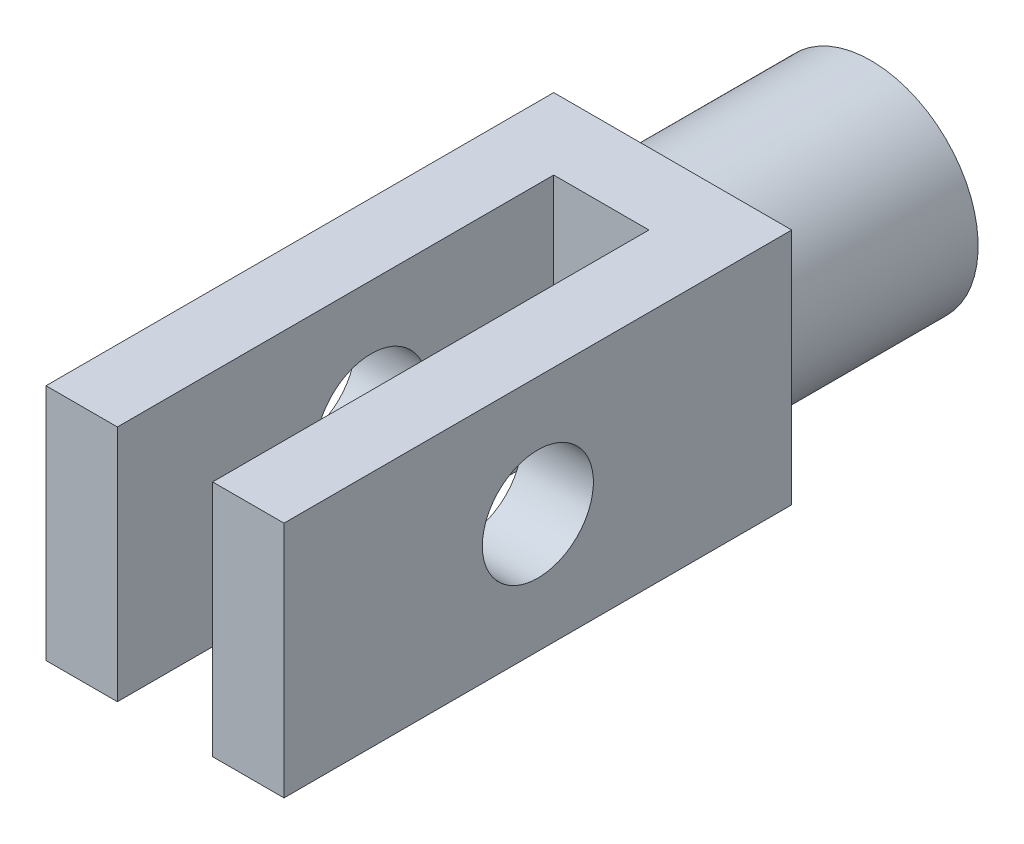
ISO-10303-21;
HEADER;
FILE_DESCRIPTION(('STEP AP214'),'2;1');
FILE_NAME('part.step','',(''),(''),'','','');
FILE_SCHEMA(('AUTOMOTIVE_DESIGN { 1 0 10303 214 1 1 1 1 }'));
ENDSEC;
DATA;
#1=APPLICATION_CONTEXT('core data for automotive mechanical design processes');
#2=APPLICATION_PROTOCOL_DEFINITION('international standard','automotive_design',2000,#1);
#3=PRODUCT_CONTEXT('',#1,'mechanical');
#4=PRODUCT('Part','Part','',(#3));
#5=PRODUCT_RELATED_PRODUCT_CATEGORY('part','',(#4));
#6=PRODUCT_DEFINITION_FORMATION('','',#4);
#7=PRODUCT_DEFINITION_CONTEXT('part definition',#1,'design');
#8=PRODUCT_DEFINITION('design','',#6,#7);
#9=PRODUCT_DEFINITION_SHAPE('','',#8);
#10=(LENGTH_UNIT() NAMED_UNIT(*) SI_UNIT(.MILLI.,.METRE.));
#11=(NAMED_UNIT(*) PLANE_ANGLE_UNIT() SI_UNIT($,.RADIAN.));
#12=(NAMED_UNIT(*) SI_UNIT($,.STERADIAN.) SOLID_ANGLE_UNIT());
#13=UNCERTAINTY_MEASURE_WITH_UNIT(LENGTH_MEASURE(1.E-05),#10,'distance_accuracy_value','');
#14=(GEOMETRIC_REPRESENTATION_CONTEXT(3) GLOBAL_UNCERTAINTY_ASSIGNED_CONTEXT((#13)) GLOBAL_UNIT_ASSIGNED_CONTEXT((#10,
#11,#12)) REPRESENTATION_CONTEXT('',''));
#15=CARTESIAN_POINT('',(0.,0.,0.));
#16=DIRECTION('',(0.,0.,1.));
#17=DIRECTION('',(1.,0.,0.));
#18=AXIS2_PLACEMENT_3D('',#15,#16,#17);
#19=CARTESIAN_POINT('',(0.,0.,0.));
#20=DIRECTION('',(0.,0.,-1.));
#21=DIRECTION('',(-1.,0.,0.));
#22=AXIS2_PLACEMENT_3D('',#19,#20,#21);
#23=PLANE('',#22);
#24=DIRECTION('',(0.,1.,0.));
#25=VECTOR('',#24,1.);
#26=CARTESIAN_POINT('',(15.,-15.,0.));
#27=LINE('',#26,#25);
#28=CARTESIAN_POINT('',(15.,-15.,0.));
#29=VERTEX_POINT('',#28);
#30=CARTESIAN_POINT('',(15.,15.,0.));
#31=VERTEX_POINT('',#30);
#32=EDGE_CURVE('E107',#29,#31,#27,.T.);
#33=ORIENTED_EDGE('',*,*,#32,.F.);
#34=DIRECTION('',(1.,0.,0.));
#35=VECTOR('',#34,1.);
#36=CARTESIAN_POINT('',(-15.,-15.,0.));
#37=LINE('',#36,#35);
#38=CARTESIAN_POINT('',(-15.,-15.,0.));
#39=VERTEX_POINT('',#38);
#40=EDGE_CURVE('E164',#39,#29,#37,.T.);
#41=ORIENTED_EDGE('',*,*,#40,.F.);
#42=DIRECTION('',(0.,-1.,0.));
#43=VECTOR('',#42,1.);
#44=CARTESIAN_POINT('',(-15.,-15.,0.));
#45=LINE('',#44,#43);
#46=CARTESIAN_POINT('',(-15.,15.,0.));
#47=VERTEX_POINT('',#46);
#48=EDGE_CURVE('E166',#47,#39,#45,.T.);
#49=ORIENTED_EDGE('',*,*,#48,.F.);
#50=DIRECTION('',(-1.,0.,0.));
#51=VECTOR('',#50,1.);
#52=CARTESIAN_POINT('',(-15.,15.,0.));
#53=LINE('',#52,#51);
#54=EDGE_CURVE('E171',#31,#47,#53,.T.);
#55=ORIENTED_EDGE('',*,*,#54,.F.);
#56=EDGE_LOOP('',(#33,#41,#49,#55));
#57=FACE_BOUND('',#56,.T.);
#58=CARTESIAN_POINT('',(0.,0.,0.));
#59=DIRECTION('',(0.,0.,-1.));
#60=DIRECTION('',(-1.,0.,0.));
#61=AXIS2_PLACEMENT_3D('',#58,#59,#60);
#62=CIRCLE('',#61,13.5);
#63=CARTESIAN_POINT('',(-13.5,0.,0.));
#64=VERTEX_POINT('',#63);
#65=EDGE_CURVE('E126',#64,#64,#62,.T.);
#66=ORIENTED_EDGE('',*,*,#65,.F.);
#67=EDGE_LOOP('',(#66));
#68=FACE_BOUND('',#67,.T.);
#69=ADVANCED_FACE('F37',(#57,#68),#23,.T.);
#70=CARTESIAN_POINT('',(0.,0.,9.));
#71=DIRECTION('',(0.,0.,-1.));
#72=DIRECTION('',(-1.,0.,0.));
#73=AXIS2_PLACEMENT_3D('',#70,#71,#72);
#74=PLANE('',#73);
#75=DIRECTION('',(0.,-1.,0.));
#76=VECTOR('',#75,1.);
#77=CARTESIAN_POINT('',(6.,15.,9.));
#78=LINE('',#77,#76);
#79=CARTESIAN_POINT('',(6.,15.,9.));
#80=VERTEX_POINT('',#79);
#81=CARTESIAN_POINT('',(6.,-15.,9.));
#82=VERTEX_POINT('',#81);
#83=EDGE_CURVE('E54',#80,#82,#78,.T.);
#84=ORIENTED_EDGE('',*,*,#83,.F.);
#85=DIRECTION('',(-1.,0.,0.));
#86=VECTOR('',#85,1.);
#87=CARTESIAN_POINT('',(-15.,15.,9.));
#88=LINE('',#87,#86);
#89=CARTESIAN_POINT('',(-6.,15.,9.));
#90=VERTEX_POINT('',#89);
#91=EDGE_CURVE('E163',#80,#90,#88,.T.);
#92=ORIENTED_EDGE('',*,*,#91,.T.);
#93=DIRECTION('',(0.,1.,0.));
#94=VECTOR('',#93,1.);
#95=CARTESIAN_POINT('',(-6.,15.,9.));
#96=LINE('',#95,#94);
#97=CARTESIAN_POINT('',(-6.,-15.,9.));
#98=VERTEX_POINT('',#97);
#99=EDGE_CURVE('E135',#98,#90,#96,.T.);
#100=ORIENTED_EDGE('',*,*,#99,.F.);
#101=DIRECTION('',(1.,0.,0.));
#102=VECTOR('',#101,1.);
#103=CARTESIAN_POINT('',(-15.,-15.,9.));
#104=LINE('',#103,#102);
#105=EDGE_CURVE('E59',#98,#82,#104,.T.);
#106=ORIENTED_EDGE('',*,*,#105,.T.);
#107=EDGE_LOOP('',(#84,#92,#100,#106));
#108=FACE_BOUND('',#107,.T.);
#109=ADVANCED_FACE('F189',(#108),#74,.F.);
#110=CARTESIAN_POINT('',(15.,-15.,9.));
#111=DIRECTION('',(-1.,0.,0.));
#112=DIRECTION('',(0.,0.,1.));
#113=AXIS2_PLACEMENT_3D('',#110,#111,#112);
#114=PLANE('',#113);
#115=CARTESIAN_POINT('',(15.,0.,32.));
#116=DIRECTION('',(-1.,0.,0.));
#117=DIRECTION('',(0.,0.,1.));
#118=AXIS2_PLACEMENT_3D('',#115,#116,#117);
#119=CIRCLE('',#118,7.);
#120=CARTESIAN_POINT('',(15.,0.,39.));
#121=VERTEX_POINT('',#120);
#122=EDGE_CURVE('E210',#121,#121,#119,.T.);
#123=ORIENTED_EDGE('',*,*,#122,.T.);
#124=EDGE_LOOP('',(#123));
#125=FACE_BOUND('',#124,.T.);
#126=ORIENTED_EDGE('',*,*,#32,.T.);
#127=DIRECTION('',(0.,0.,-1.));
#128=VECTOR('',#127,1.);
#129=CARTESIAN_POINT('',(15.,15.,9.));
#130=LINE('',#129,#128);
#131=CARTESIAN_POINT('',(15.,15.,64.));
#132=VERTEX_POINT('',#131);
#133=EDGE_CURVE('E11',#132,#31,#130,.T.);
#134=ORIENTED_EDGE('',*,*,#133,.F.);
#135=DIRECTION('',(0.,1.,0.));
#136=VECTOR('',#135,1.);
#137=CARTESIAN_POINT('',(15.,15.,64.));
#138=LINE('',#137,#136);
#139=CARTESIAN_POINT('',(15.,-15.,64.));
#140=VERTEX_POINT('',#139);
#141=EDGE_CURVE('E105',#140,#132,#138,.T.);
#142=ORIENTED_EDGE('',*,*,#141,.F.);
#143=DIRECTION('',(0.,0.,-1.));
#144=VECTOR('',#143,1.);
#145=CARTESIAN_POINT('',(15.,-15.,9.));
#146=LINE('',#145,#144);
#147=EDGE_CURVE('E165',#140,#29,#146,.T.);
#148=ORIENTED_EDGE('',*,*,#147,.T.);
#149=EDGE_LOOP('',(#126,#134,#142,#148));
#150=FACE_BOUND('',#149,.T.);
#151=ADVANCED_FACE('F39',(#125,#150),#114,.F.);
#152=CARTESIAN_POINT('',(-15.,15.,9.));
#153=DIRECTION('',(0.,-1.,0.));
#154=DIRECTION('',(0.,0.,-1.));
#155=AXIS2_PLACEMENT_3D('',#152,#153,#154);
#156=PLANE('',#155);
#157=ORIENTED_EDGE('',*,*,#54,.T.);
#158=DIRECTION('',(0.,0.,-1.));
#159=VECTOR('',#158,1.);
#160=CARTESIAN_POINT('',(-15.,15.,9.));
#161=LINE('',#160,#159);
#162=CARTESIAN_POINT('',(-15.,15.,64.));
#163=VERTEX_POINT('',#162);
#164=EDGE_CURVE('E46',#163,#47,#161,.T.);
#165=ORIENTED_EDGE('',*,*,#164,.F.);
#166=DIRECTION('',(-1.,0.,0.));
#167=VECTOR('',#166,1.);
#168=CARTESIAN_POINT('',(-15.,15.,64.));
#169=LINE('',#168,#167);
#170=CARTESIAN_POINT('',(-6.,15.,64.));
#171=VERTEX_POINT('',#170);
#172=EDGE_CURVE('E143',#171,#163,#169,.T.);
#173=ORIENTED_EDGE('',*,*,#172,.F.);
#174=DIRECTION('',(0.,0.,-1.));
#175=VECTOR('',#174,1.);
#176=CARTESIAN_POINT('',(-6.,15.,64.));
#177=LINE('',#176,#175);
#178=EDGE_CURVE('E146',#171,#90,#177,.T.);
#179=ORIENTED_EDGE('',*,*,#178,.T.);
#180=ORIENTED_EDGE('',*,*,#91,.F.);
#181=DIRECTION('',(0.,0.,-1.));
#182=VECTOR('',#181,1.);
#183=CARTESIAN_POINT('',(6.,15.,64.));
#184=LINE('',#183,#182);
#185=CARTESIAN_POINT('',(6.,15.,64.));
#186=VERTEX_POINT('',#185);
#187=EDGE_CURVE('E113',#186,#80,#184,.T.);
#188=ORIENTED_EDGE('',*,*,#187,.F.);
#189=DIRECTION('',(-1.,0.,0.));
#190=VECTOR('',#189,1.);
#191=CARTESIAN_POINT('',(15.,15.,64.));
#192=LINE('',#191,#190);
#193=EDGE_CURVE('E110',#132,#186,#192,.T.);
#194=ORIENTED_EDGE('',*,*,#193,.F.);
#195=ORIENTED_EDGE('',*,*,#133,.T.);
#196=EDGE_LOOP('',(#157,#165,#173,#179,#180,#188,#194,#195));
#197=FACE_BOUND('',#196,.T.);
#198=ADVANCED_FACE('F111',(#197),#156,.F.);
#199=CARTESIAN_POINT('',(-15.,-15.,9.));
#200=DIRECTION('',(1.,0.,0.));
#201=DIRECTION('',(0.,0.,-1.));
#202=AXIS2_PLACEMENT_3D('',#199,#200,#201);
#203=PLANE('',#202);
#204=CARTESIAN_POINT('',(-15.,0.,32.));
#205=DIRECTION('',(-1.,0.,0.));
#206=DIRECTION('',(0.,0.,1.));
#207=AXIS2_PLACEMENT_3D('',#204,#205,#206);
#208=CIRCLE('',#207,7.);
#209=CARTESIAN_POINT('',(-15.,0.,39.));
#210=VERTEX_POINT('',#209);
#211=EDGE_CURVE('E207',#210,#210,#208,.T.);
#212=ORIENTED_EDGE('',*,*,#211,.F.);
#213=EDGE_LOOP('',(#212));
#214=FACE_BOUND('',#213,.T.);
#215=ORIENTED_EDGE('',*,*,#48,.T.);
#216=DIRECTION('',(0.,0.,-1.));
#217=VECTOR('',#216,1.);
#218=CARTESIAN_POINT('',(-15.,-15.,9.));
#219=LINE('',#218,#217);
#220=CARTESIAN_POINT('',(-15.,-15.,64.));
#221=VERTEX_POINT('',#220);
#222=EDGE_CURVE('E176',#221,#39,#219,.T.);
#223=ORIENTED_EDGE('',*,*,#222,.F.);
#224=DIRECTION('',(0.,-1.,0.));
#225=VECTOR('',#224,1.);
#226=CARTESIAN_POINT('',(-15.,15.,64.));
#227=LINE('',#226,#225);
#228=EDGE_CURVE('E136',#163,#221,#227,.T.);
#229=ORIENTED_EDGE('',*,*,#228,.F.);
#230=ORIENTED_EDGE('',*,*,#164,.T.);
#231=EDGE_LOOP('',(#215,#223,#229,#230));
#232=FACE_BOUND('',#231,.T.);
#233=ADVANCED_FACE('F182',(#214,#232),#203,.F.);
#234=CARTESIAN_POINT('',(-15.,-15.,9.));
#235=DIRECTION('',(0.,1.,0.));
#236=DIRECTION('',(0.,0.,1.));
#237=AXIS2_PLACEMENT_3D('',#234,#235,#236);
#238=PLANE('',#237);
#239=ORIENTED_EDGE('',*,*,#40,.T.);
#240=ORIENTED_EDGE('',*,*,#147,.F.);
#241=DIRECTION('',(1.,0.,0.));
#242=VECTOR('',#241,1.);
#243=CARTESIAN_POINT('',(15.,-15.,64.));
#244=LINE('',#243,#242);
#245=CARTESIAN_POINT('',(6.,-15.,64.));
#246=VERTEX_POINT('',#245);
#247=EDGE_CURVE('E121',#246,#140,#244,.T.);
#248=ORIENTED_EDGE('',*,*,#247,.F.);
#249=DIRECTION('',(0.,0.,-1.));
#250=VECTOR('',#249,1.);
#251=CARTESIAN_POINT('',(6.,-15.,64.));
#252=LINE('',#251,#250);
#253=EDGE_CURVE('E130',#246,#82,#252,.T.);
#254=ORIENTED_EDGE('',*,*,#253,.T.);
#255=ORIENTED_EDGE('',*,*,#105,.F.);
#256=DIRECTION('',(0.,0.,-1.));
#257=VECTOR('',#256,1.);
#258=CARTESIAN_POINT('',(-6.,-15.,64.));
#259=LINE('',#258,#257);
#260=CARTESIAN_POINT('',(-6.,-15.,64.));
#261=VERTEX_POINT('',#260);
#262=EDGE_CURVE('E157',#261,#98,#259,.T.);
#263=ORIENTED_EDGE('',*,*,#262,.F.);
#264=DIRECTION('',(1.,0.,0.));
#265=VECTOR('',#264,1.);
#266=CARTESIAN_POINT('',(-15.,-15.,64.));
#267=LINE('',#266,#265);
#268=EDGE_CURVE('E139',#221,#261,#267,.T.);
#269=ORIENTED_EDGE('',*,*,#268,.F.);
#270=ORIENTED_EDGE('',*,*,#222,.T.);
#271=EDGE_LOOP('',(#239,#240,#248,#254,#255,#263,#269,#270));
#272=FACE_BOUND('',#271,.T.);
#273=ADVANCED_FACE('F256',(#272),#238,.F.);
#274=CARTESIAN_POINT('',(-6.,15.,64.));
#275=DIRECTION('',(-1.,0.,0.));
#276=DIRECTION('',(0.,-1.,0.));
#277=AXIS2_PLACEMENT_3D('',#274,#275,#276);
#278=PLANE('',#277);
#279=CARTESIAN_POINT('',(-6.,0.,32.));
#280=DIRECTION('',(-1.,0.,0.));
#281=DIRECTION('',(0.,-1.,0.));
#282=AXIS2_PLACEMENT_3D('',#279,#280,#281);
#283=CIRCLE('',#282,7.);
#284=CARTESIAN_POINT('',(-6.,-7.,32.));
#285=VERTEX_POINT('',#284);
#286=EDGE_CURVE('E202',#285,#285,#283,.T.);
#287=ORIENTED_EDGE('',*,*,#286,.T.);
#288=EDGE_LOOP('',(#287));
#289=FACE_BOUND('',#288,.T.);
#290=ORIENTED_EDGE('',*,*,#99,.T.);
#291=ORIENTED_EDGE('',*,*,#178,.F.);
#292=DIRECTION('',(0.,1.,0.));
#293=VECTOR('',#292,1.);
#294=CARTESIAN_POINT('',(-6.,15.,64.));
#295=LINE('',#294,#293);
#296=EDGE_CURVE('E141',#261,#171,#295,.T.);
#297=ORIENTED_EDGE('',*,*,#296,.F.);
#298=ORIENTED_EDGE('',*,*,#262,.T.);
#299=EDGE_LOOP('',(#290,#291,#297,#298));
#300=FACE_BOUND('',#299,.T.);
#301=ADVANCED_FACE('F252',(#289,#300),#278,.F.);
#302=CARTESIAN_POINT('',(0.,0.,64.));
#303=DIRECTION('',(0.,0.,1.));
#304=DIRECTION('',(1.,0.,0.));
#305=AXIS2_PLACEMENT_3D('',#302,#303,#304);
#306=PLANE('',#305);
#307=ORIENTED_EDGE('',*,*,#228,.T.);
#308=ORIENTED_EDGE('',*,*,#268,.T.);
#309=ORIENTED_EDGE('',*,*,#296,.T.);
#310=ORIENTED_EDGE('',*,*,#172,.T.);
#311=EDGE_LOOP('',(#307,#308,#309,#310));
#312=FACE_BOUND('',#311,.T.);
#313=ADVANCED_FACE('F249',(#312),#306,.T.);
#314=CARTESIAN_POINT('',(6.,15.,64.));
#315=DIRECTION('',(1.,0.,0.));
#316=DIRECTION('',(0.,1.,0.));
#317=AXIS2_PLACEMENT_3D('',#314,#315,#316);
#318=PLANE('',#317);
#319=CARTESIAN_POINT('',(6.,0.,32.));
#320=DIRECTION('',(1.,0.,0.));
#321=DIRECTION('',(0.,1.,0.));
#322=AXIS2_PLACEMENT_3D('',#319,#320,#321);
#323=CIRCLE('',#322,7.);
#324=CARTESIAN_POINT('',(6.,7.,32.));
#325=VERTEX_POINT('',#324);
#326=EDGE_CURVE('E41',#325,#325,#323,.T.);
#327=ORIENTED_EDGE('',*,*,#326,.T.);
#328=EDGE_LOOP('',(#327));
#329=FACE_BOUND('',#328,.T.);
#330=ORIENTED_EDGE('',*,*,#83,.T.);
#331=ORIENTED_EDGE('',*,*,#253,.F.);
#332=DIRECTION('',(0.,-1.,0.));
#333=VECTOR('',#332,1.);
#334=CARTESIAN_POINT('',(6.,15.,64.));
#335=LINE('',#334,#333);
#336=EDGE_CURVE('E116',#186,#246,#335,.T.);
#337=ORIENTED_EDGE('',*,*,#336,.F.);
#338=ORIENTED_EDGE('',*,*,#187,.T.);
#339=EDGE_LOOP('',(#330,#331,#337,#338));
#340=FACE_BOUND('',#339,.T.);
#341=ADVANCED_FACE('F217',(#329,#340),#318,.F.);
#342=CARTESIAN_POINT('',(0.,0.,64.));
#343=DIRECTION('',(0.,0.,-1.));
#344=DIRECTION('',(-1.,0.,0.));
#345=AXIS2_PLACEMENT_3D('',#342,#343,#344);
#346=PLANE('',#345);
#347=ORIENTED_EDGE('',*,*,#141,.T.);
#348=ORIENTED_EDGE('',*,*,#193,.T.);
#349=ORIENTED_EDGE('',*,*,#336,.T.);
#350=ORIENTED_EDGE('',*,*,#247,.T.);
#351=EDGE_LOOP('',(#347,#348,#349,#350));
#352=FACE_BOUND('',#351,.T.);
#353=ADVANCED_FACE('F119',(#352),#346,.F.);
#354=CARTESIAN_POINT('',(0.,0.,-25.));
#355=DIRECTION('',(0.,0.,1.));
#356=DIRECTION('',(1.,0.,0.));
#357=AXIS2_PLACEMENT_3D('',#354,#355,#356);
#358=CYLINDRICAL_SURFACE('',#357,13.5);
#359=CARTESIAN_POINT('',(0.,0.,-25.));
#360=DIRECTION('',(0.,0.,-1.));
#361=DIRECTION('',(-1.,0.,0.));
#362=AXIS2_PLACEMENT_3D('',#359,#360,#361);
#363=CIRCLE('',#362,13.5);
#364=CARTESIAN_POINT('',(-13.5,0.,-25.));
#365=VERTEX_POINT('',#364);
#366=EDGE_CURVE('E123',#365,#365,#363,.T.);
#367=ORIENTED_EDGE('',*,*,#366,.F.);
#368=EDGE_LOOP('',(#367));
#369=FACE_BOUND('',#368,.T.);
#370=ORIENTED_EDGE('',*,*,#65,.T.);
#371=EDGE_LOOP('',(#370));
#372=FACE_BOUND('',#371,.T.);
#373=ADVANCED_FACE('F240',(#369,#372),#358,.T.);
#374=CARTESIAN_POINT('',(0.,0.,-25.));
#375=DIRECTION('',(0.,0.,-1.));
#376=DIRECTION('',(-1.,0.,0.));
#377=AXIS2_PLACEMENT_3D('',#374,#375,#376);
#378=PLANE('',#377);
#379=CARTESIAN_POINT('',(0.,0.,-25.));
#380=DIRECTION('',(0.,0.,-1.));
#381=DIRECTION('',(-1.,0.,0.));
#382=AXIS2_PLACEMENT_3D('',#379,#380,#381);
#383=CIRCLE('',#382,8.);
#384=CARTESIAN_POINT('',(-8.,0.,-25.));
#385=VERTEX_POINT('',#384);
#386=EDGE_CURVE('E197',#385,#385,#383,.T.);
#387=ORIENTED_EDGE('',*,*,#386,.F.);
#388=EDGE_LOOP('',(#387));
#389=FACE_BOUND('',#388,.T.);
#390=ORIENTED_EDGE('',*,*,#366,.T.);
#391=EDGE_LOOP('',(#390));
#392=FACE_BOUND('',#391,.T.);
#393=ADVANCED_FACE('F236',(#389,#392),#378,.T.);
#394=CARTESIAN_POINT('',(0.,0.,0.));
#395=DIRECTION('',(0.,0.,-1.));
#396=DIRECTION('',(-1.,0.,0.));
#397=AXIS2_PLACEMENT_3D('',#394,#395,#396);
#398=CYLINDRICAL_SURFACE('',#397,8.);
#399=CARTESIAN_POINT('',(0.,0.,0.));
#400=DIRECTION('',(0.,0.,-1.));
#401=DIRECTION('',(-1.,0.,0.));
#402=AXIS2_PLACEMENT_3D('',#399,#400,#401);
#403=CIRCLE('',#402,8.);
#404=CARTESIAN_POINT('',(-8.,0.,0.));
#405=VERTEX_POINT('',#404);
#406=EDGE_CURVE('E194',#405,#405,#403,.T.);
#407=ORIENTED_EDGE('',*,*,#406,.F.);
#408=EDGE_LOOP('',(#407));
#409=FACE_BOUND('',#408,.T.);
#410=ORIENTED_EDGE('',*,*,#386,.T.);
#411=EDGE_LOOP('',(#410));
#412=FACE_BOUND('',#411,.T.);
#413=ADVANCED_FACE('F231',(#409,#412),#398,.F.);
#414=CARTESIAN_POINT('',(0.,0.,0.));
#415=DIRECTION('',(0.,0.,-1.));
#416=DIRECTION('',(-1.,0.,0.));
#417=AXIS2_PLACEMENT_3D('',#414,#415,#416);
#418=PLANE('',#417);
#419=ORIENTED_EDGE('',*,*,#406,.T.);
#420=EDGE_LOOP('',(#419));
#421=FACE_BOUND('',#420,.T.);
#422=ADVANCED_FACE('F223',(#421),#418,.T.);
#423=CARTESIAN_POINT('',(15.,0.,32.));
#424=DIRECTION('',(-1.,0.,0.));
#425=DIRECTION('',(0.,0.,1.));
#426=AXIS2_PLACEMENT_3D('',#423,#424,#425);
#427=CYLINDRICAL_SURFACE('',#426,7.);
#428=ORIENTED_EDGE('',*,*,#122,.F.);
#429=EDGE_LOOP('',(#428));
#430=FACE_BOUND('',#429,.T.);
#431=ORIENTED_EDGE('',*,*,#326,.F.);
#432=EDGE_LOOP('',(#431));
#433=FACE_BOUND('',#432,.T.);
#434=ADVANCED_FACE('F220',(#430,#433),#427,.F.);
#435=ORIENTED_EDGE('',*,*,#211,.T.);
#436=EDGE_LOOP('',(#435));
#437=FACE_BOUND('',#436,.T.);
#438=ORIENTED_EDGE('',*,*,#286,.F.);
#439=EDGE_LOOP('',(#438));
#440=FACE_BOUND('',#439,.T.);
#441=ADVANCED_FACE('F222',(#437,#440),#427,.F.);
#442=CLOSED_SHELL('',(#69,#109,#151,#198,#233,#273,#301,#313,#341,#353,#373,#393,#413,#422,#434,#441));
#443=MANIFOLD_SOLID_BREP('B2',#442);
#444=ADVANCED_BREP_SHAPE_REPRESENTATION('',(#18,#443),#14);
#445=SHAPE_DEFINITION_REPRESENTATION(#9,#444);
ENDSEC;
END-ISO-10303-21;
